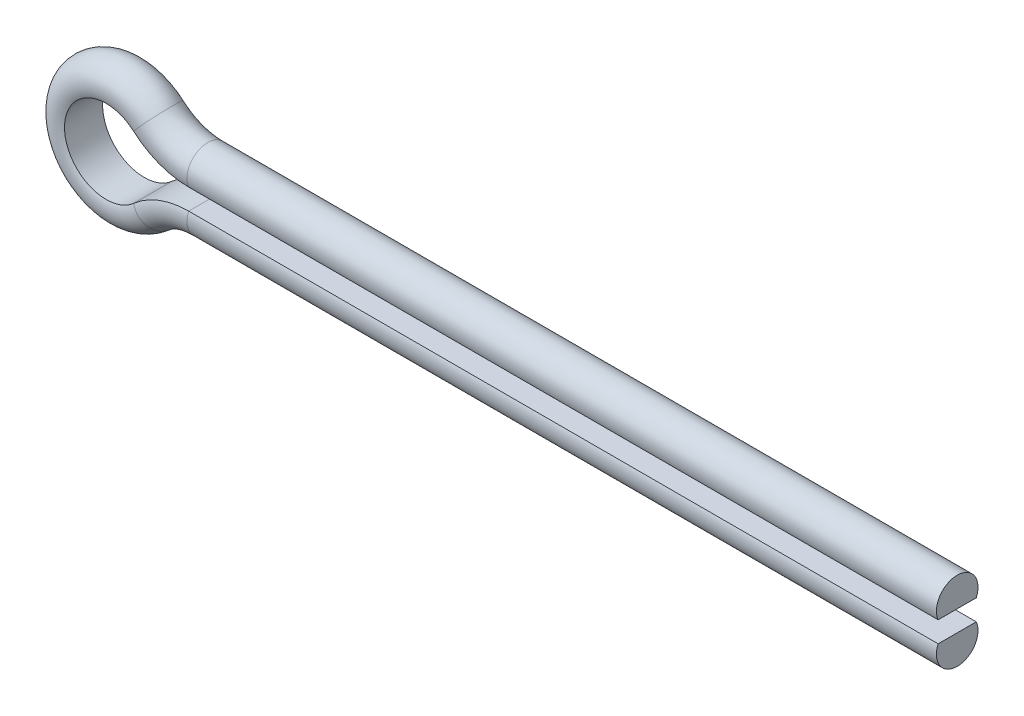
from build123d import *


with BuildPart() as part:
    # Sweep1: sweep along a path in Sketch1
    with BuildLine(Plane.XY) as sweep1_path:
        Line((100, 1.25), (9.921567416, 1.25))
        ThreePointArc((9.921567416, 1.25), (6.386033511, 1.895856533), (3.307189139, 3.75))
        ThreePointArc((3.307189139, 3.75), (-5, 0), (3.307189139, -3.75))
        ThreePointArc((3.307189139, -3.75), (6.386033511, -1.895856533), (9.921567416, -1.25))
        Line((9.921567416, -1.25), (100, -1.25))
    # Sketch2 → Sweep1 (sweep)
    with BuildSketch(Plane(origin=(100, 1.25, 0), x_dir=(0, 0, 1), z_dir=(-1, 0, 0))):
        with BuildLine():
            Line((-2.291287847, 0), (2.291287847, 0))
            ThreePointArc((2.291287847, 0), (0, 3.5), (-2.291287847, 0))
        make_face()
    sweep(path=sweep1_path.line)


solid = part.part
